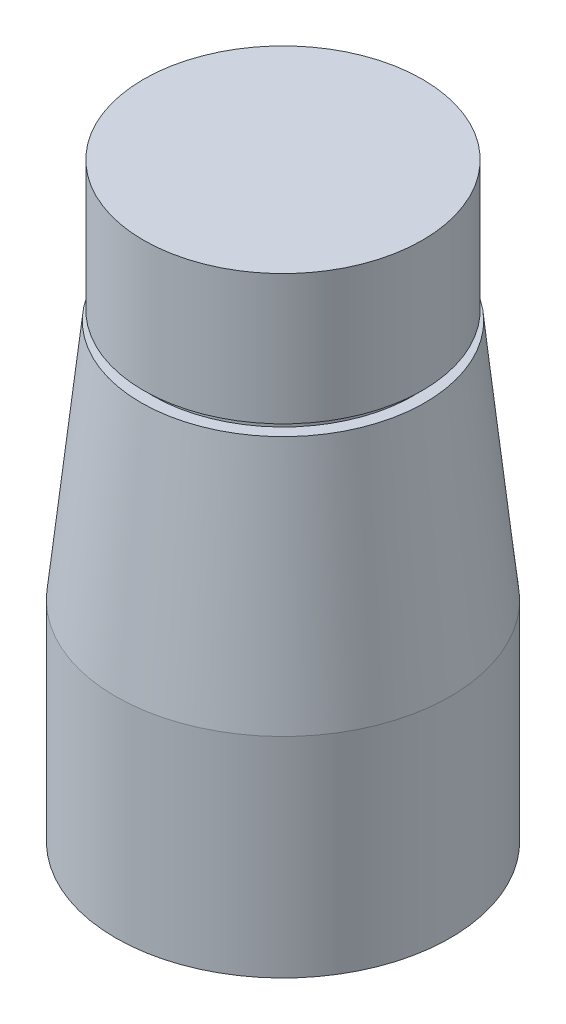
ISO-10303-21;
HEADER;
FILE_DESCRIPTION(('STEP AP214'),'2;1');
FILE_NAME('part.step','',(''),(''),'','','');
FILE_SCHEMA(('AUTOMOTIVE_DESIGN { 1 0 10303 214 1 1 1 1 }'));
ENDSEC;
DATA;
#1=APPLICATION_CONTEXT('core data for automotive mechanical design processes');
#2=APPLICATION_PROTOCOL_DEFINITION('international standard','automotive_design',2000,#1);
#3=PRODUCT_CONTEXT('',#1,'mechanical');
#4=PRODUCT('Part','Part','',(#3));
#5=PRODUCT_RELATED_PRODUCT_CATEGORY('part','',(#4));
#6=PRODUCT_DEFINITION_FORMATION('','',#4);
#7=PRODUCT_DEFINITION_CONTEXT('part definition',#1,'design');
#8=PRODUCT_DEFINITION('design','',#6,#7);
#9=PRODUCT_DEFINITION_SHAPE('','',#8);
#10=(LENGTH_UNIT() NAMED_UNIT(*) SI_UNIT(.MILLI.,.METRE.));
#11=(NAMED_UNIT(*) PLANE_ANGLE_UNIT() SI_UNIT($,.RADIAN.));
#12=(NAMED_UNIT(*) SI_UNIT($,.STERADIAN.) SOLID_ANGLE_UNIT());
#13=UNCERTAINTY_MEASURE_WITH_UNIT(LENGTH_MEASURE(1.E-05),#10,'distance_accuracy_value','');
#14=(GEOMETRIC_REPRESENTATION_CONTEXT(3) GLOBAL_UNCERTAINTY_ASSIGNED_CONTEXT((#13)) GLOBAL_UNIT_ASSIGNED_CONTEXT((#10,
#11,#12)) REPRESENTATION_CONTEXT('',''));
#15=CARTESIAN_POINT('',(0.,0.,0.));
#16=DIRECTION('',(0.,0.,1.));
#17=DIRECTION('',(1.,0.,0.));
#18=AXIS2_PLACEMENT_3D('',#15,#16,#17);
#19=CARTESIAN_POINT('',(0.,0.,0.));
#20=DIRECTION('',(0.,-1.,0.));
#21=DIRECTION('',(0.,0.,-1.));
#22=AXIS2_PLACEMENT_3D('',#19,#20,#21);
#23=PLANE('',#22);
#24=CARTESIAN_POINT('',(0.,0.,0.));
#25=DIRECTION('',(0.,1.,0.));
#26=DIRECTION('',(0.,0.,1.));
#27=AXIS2_PLACEMENT_3D('',#24,#25,#26);
#28=CIRCLE('',#27,18.);
#29=CARTESIAN_POINT('',(0.,0.,18.));
#30=VERTEX_POINT('',#29);
#31=EDGE_CURVE('E10',#30,#30,#28,.T.);
#32=ORIENTED_EDGE('',*,*,#31,.F.);
#33=EDGE_LOOP('',(#32));
#34=FACE_BOUND('',#33,.T.);
#35=ADVANCED_FACE('F31',(#34),#23,.T.);
#36=CARTESIAN_POINT('',(0.,85.1026449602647,0.));
#37=DIRECTION('',(0.,1.,0.));
#38=DIRECTION('',(0.,0.,1.));
#39=AXIS2_PLACEMENT_3D('',#36,#37,#38);
#40=CYLINDRICAL_SURFACE('',#39,18.);
#41=ORIENTED_EDGE('',*,*,#31,.T.);
#42=EDGE_LOOP('',(#41));
#43=FACE_BOUND('',#42,.T.);
#44=CARTESIAN_POINT('',(0.,22.5,0.));
#45=DIRECTION('',(0.,1.,0.));
#46=DIRECTION('',(0.,0.,1.));
#47=AXIS2_PLACEMENT_3D('',#44,#45,#46);
#48=CIRCLE('',#47,18.);
#49=CARTESIAN_POINT('',(0.,22.5,18.));
#50=VERTEX_POINT('',#49);
#51=EDGE_CURVE('E37',#50,#50,#48,.T.);
#52=ORIENTED_EDGE('',*,*,#51,.F.);
#53=EDGE_LOOP('',(#52));
#54=FACE_BOUND('',#53,.T.);
#55=ADVANCED_FACE('F76',(#43,#54),#40,.T.);
#56=CARTESIAN_POINT('',(0.,48.5,0.));
#57=DIRECTION('',(0.,-1.,0.));
#58=DIRECTION('',(0.,0.,-1.));
#59=AXIS2_PLACEMENT_3D('',#56,#57,#58);
#60=CONICAL_SURFACE('',#59,15.2672898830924,0.10471975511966);
#61=ORIENTED_EDGE('',*,*,#51,.T.);
#62=EDGE_LOOP('',(#61));
#63=FACE_BOUND('',#62,.T.);
#64=CARTESIAN_POINT('',(0.,48.5,0.));
#65=DIRECTION('',(0.,1.,0.));
#66=DIRECTION('',(0.,0.,1.));
#67=AXIS2_PLACEMENT_3D('',#64,#65,#66);
#68=CIRCLE('',#67,15.2672898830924);
#69=CARTESIAN_POINT('',(0.,48.5,15.2672898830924));
#70=VERTEX_POINT('',#69);
#71=EDGE_CURVE('E41',#70,#70,#68,.T.);
#72=ORIENTED_EDGE('',*,*,#71,.F.);
#73=EDGE_LOOP('',(#72));
#74=FACE_BOUND('',#73,.T.);
#75=ADVANCED_FACE('F81',(#63,#74),#60,.T.);
#76=CARTESIAN_POINT('',(-15.2672898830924,48.5,0.));
#77=DIRECTION('',(0.,1.,0.));
#78=DIRECTION('',(0.,0.,1.));
#79=AXIS2_PLACEMENT_3D('',#76,#77,#78);
#80=PLANE('',#79);
#81=ORIENTED_EDGE('',*,*,#71,.T.);
#82=EDGE_LOOP('',(#81));
#83=FACE_BOUND('',#82,.T.);
#84=CARTESIAN_POINT('',(0.,48.5,0.));
#85=DIRECTION('',(0.,1.,0.));
#86=DIRECTION('',(0.,0.,1.));
#87=AXIS2_PLACEMENT_3D('',#84,#85,#86);
#88=CIRCLE('',#87,14.);
#89=CARTESIAN_POINT('',(0.,48.5,14.));
#90=VERTEX_POINT('',#89);
#91=EDGE_CURVE('E45',#90,#90,#88,.T.);
#92=ORIENTED_EDGE('',*,*,#91,.F.);
#93=EDGE_LOOP('',(#92));
#94=FACE_BOUND('',#93,.T.);
#95=ADVANCED_FACE('F85',(#83,#94),#80,.T.);
#96=CARTESIAN_POINT('',(0.,85.1026449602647,0.));
#97=DIRECTION('',(0.,1.,0.));
#98=DIRECTION('',(0.,0.,1.));
#99=AXIS2_PLACEMENT_3D('',#96,#97,#98);
#100=CYLINDRICAL_SURFACE('',#99,14.);
#101=ORIENTED_EDGE('',*,*,#91,.T.);
#102=EDGE_LOOP('',(#101));
#103=FACE_BOUND('',#102,.T.);
#104=CARTESIAN_POINT('',(0.,49.5,0.));
#105=DIRECTION('',(0.,1.,0.));
#106=DIRECTION('',(0.,0.,1.));
#107=AXIS2_PLACEMENT_3D('',#104,#105,#106);
#108=CIRCLE('',#107,14.);
#109=CARTESIAN_POINT('',(0.,49.5,14.));
#110=VERTEX_POINT('',#109);
#111=EDGE_CURVE('E50',#110,#110,#108,.T.);
#112=ORIENTED_EDGE('',*,*,#111,.F.);
#113=EDGE_LOOP('',(#112));
#114=FACE_BOUND('',#113,.T.);
#115=ADVANCED_FACE('F72',(#103,#114),#100,.T.);
#116=CARTESIAN_POINT('',(-14.,49.5,0.));
#117=DIRECTION('',(0.,-1.,0.));
#118=DIRECTION('',(0.,0.,-1.));
#119=AXIS2_PLACEMENT_3D('',#116,#117,#118);
#120=PLANE('',#119);
#121=ORIENTED_EDGE('',*,*,#111,.T.);
#122=EDGE_LOOP('',(#121));
#123=FACE_BOUND('',#122,.T.);
#124=CARTESIAN_POINT('',(0.,49.5,0.));
#125=DIRECTION('',(0.,1.,0.));
#126=DIRECTION('',(0.,0.,1.));
#127=AXIS2_PLACEMENT_3D('',#124,#125,#126);
#128=CIRCLE('',#127,15.);
#129=CARTESIAN_POINT('',(0.,49.5,15.));
#130=VERTEX_POINT('',#129);
#131=EDGE_CURVE('E53',#130,#130,#128,.T.);
#132=ORIENTED_EDGE('',*,*,#131,.F.);
#133=EDGE_LOOP('',(#132));
#134=FACE_BOUND('',#133,.T.);
#135=ADVANCED_FACE('F64',(#123,#134),#120,.T.);
#136=CARTESIAN_POINT('',(0.,85.1026449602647,0.));
#137=DIRECTION('',(0.,1.,0.));
#138=DIRECTION('',(0.,0.,1.));
#139=AXIS2_PLACEMENT_3D('',#136,#137,#138);
#140=CYLINDRICAL_SURFACE('',#139,15.);
#141=ORIENTED_EDGE('',*,*,#131,.T.);
#142=EDGE_LOOP('',(#141));
#143=FACE_BOUND('',#142,.T.);
#144=CARTESIAN_POINT('',(0.,63.5,0.));
#145=DIRECTION('',(0.,1.,0.));
#146=DIRECTION('',(0.,0.,1.));
#147=AXIS2_PLACEMENT_3D('',#144,#145,#146);
#148=CIRCLE('',#147,15.);
#149=CARTESIAN_POINT('',(0.,63.5,15.));
#150=VERTEX_POINT('',#149);
#151=EDGE_CURVE('E56',#150,#150,#148,.T.);
#152=ORIENTED_EDGE('',*,*,#151,.F.);
#153=EDGE_LOOP('',(#152));
#154=FACE_BOUND('',#153,.T.);
#155=ADVANCED_FACE('F62',(#143,#154),#140,.T.);
#156=CARTESIAN_POINT('',(-15.,63.5,0.));
#157=DIRECTION('',(0.,1.,0.));
#158=DIRECTION('',(0.,0.,1.));
#159=AXIS2_PLACEMENT_3D('',#156,#157,#158);
#160=PLANE('',#159);
#161=ORIENTED_EDGE('',*,*,#151,.T.);
#162=EDGE_LOOP('',(#161));
#163=FACE_BOUND('',#162,.T.);
#164=ADVANCED_FACE('F60',(#163),#160,.T.);
#165=CLOSED_SHELL('',(#35,#55,#75,#95,#115,#135,#155,#164));
#166=MANIFOLD_SOLID_BREP('B2',#165);
#167=ADVANCED_BREP_SHAPE_REPRESENTATION('',(#18,#166),#14);
#168=SHAPE_DEFINITION_REPRESENTATION(#9,#167);
ENDSEC;
END-ISO-10303-21;
